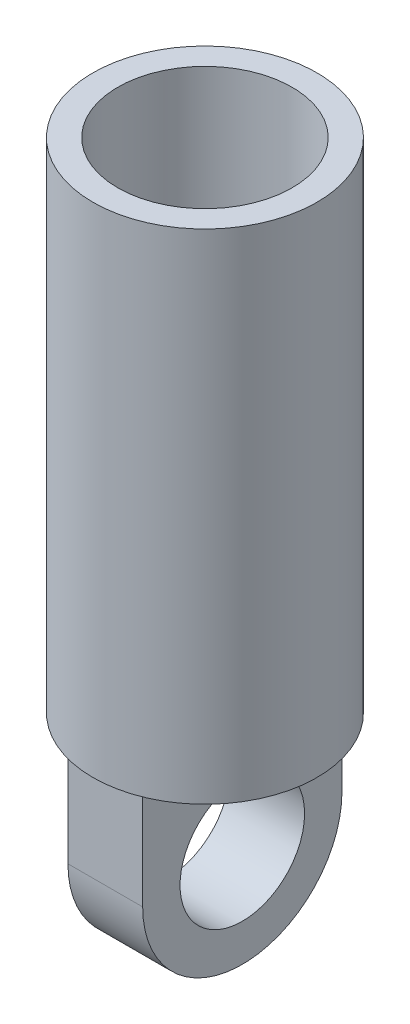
ISO-10303-21;
HEADER;
FILE_DESCRIPTION(('STEP AP214'),'2;1');
FILE_NAME('part.step','',(''),(''),'','','');
FILE_SCHEMA(('AUTOMOTIVE_DESIGN { 1 0 10303 214 1 1 1 1 }'));
ENDSEC;
DATA;
#1=APPLICATION_CONTEXT('core data for automotive mechanical design processes');
#2=APPLICATION_PROTOCOL_DEFINITION('international standard','automotive_design',2000,#1);
#3=PRODUCT_CONTEXT('',#1,'mechanical');
#4=PRODUCT('Part','Part','',(#3));
#5=PRODUCT_RELATED_PRODUCT_CATEGORY('part','',(#4));
#6=PRODUCT_DEFINITION_FORMATION('','',#4);
#7=PRODUCT_DEFINITION_CONTEXT('part definition',#1,'design');
#8=PRODUCT_DEFINITION('design','',#6,#7);
#9=PRODUCT_DEFINITION_SHAPE('','',#8);
#10=(LENGTH_UNIT() NAMED_UNIT(*) SI_UNIT(.MILLI.,.METRE.));
#11=(NAMED_UNIT(*) PLANE_ANGLE_UNIT() SI_UNIT($,.RADIAN.));
#12=(NAMED_UNIT(*) SI_UNIT($,.STERADIAN.) SOLID_ANGLE_UNIT());
#13=UNCERTAINTY_MEASURE_WITH_UNIT(LENGTH_MEASURE(1.E-05),#10,'distance_accuracy_value','');
#14=(GEOMETRIC_REPRESENTATION_CONTEXT(3) GLOBAL_UNCERTAINTY_ASSIGNED_CONTEXT((#13)) GLOBAL_UNIT_ASSIGNED_CONTEXT((#10,
#11,#12)) REPRESENTATION_CONTEXT('',''));
#15=CARTESIAN_POINT('',(0.,0.,0.));
#16=DIRECTION('',(0.,0.,1.));
#17=DIRECTION('',(1.,0.,0.));
#18=AXIS2_PLACEMENT_3D('',#15,#16,#17);
#19=CARTESIAN_POINT('',(37.5,0.,0.));
#20=DIRECTION('',(1.,0.,0.));
#21=DIRECTION('',(0.,0.,-1.));
#22=AXIS2_PLACEMENT_3D('',#19,#20,#21);
#23=PLANE('',#22);
#24=CARTESIAN_POINT('',(37.5,0.,0.));
#25=DIRECTION('',(1.,0.,0.));
#26=DIRECTION('',(0.,0.,-1.));
#27=AXIS2_PLACEMENT_3D('',#24,#25,#26);
#28=CIRCLE('',#27,100.);
#29=CARTESIAN_POINT('',(37.5,0.,100.));
#30=VERTEX_POINT('',#29);
#31=CARTESIAN_POINT('',(37.5,0.,-100.));
#32=VERTEX_POINT('',#31);
#33=EDGE_CURVE('E110',#30,#32,#28,.T.);
#34=ORIENTED_EDGE('',*,*,#33,.T.);
#35=DIRECTION('',(0.,1.,0.));
#36=VECTOR('',#35,1.);
#37=CARTESIAN_POINT('',(37.5,100.,-100.));
#38=LINE('',#37,#36);
#39=CARTESIAN_POINT('',(37.5,100.,-100.));
#40=VERTEX_POINT('',#39);
#41=EDGE_CURVE('E85',#32,#40,#38,.T.);
#42=ORIENTED_EDGE('',*,*,#41,.T.);
#43=DIRECTION('',(0.,0.,1.));
#44=VECTOR('',#43,1.);
#45=CARTESIAN_POINT('',(37.5,100.,100.));
#46=LINE('',#45,#44);
#47=CARTESIAN_POINT('',(37.5,100.,100.));
#48=VERTEX_POINT('',#47);
#49=EDGE_CURVE('E103',#40,#48,#46,.T.);
#50=ORIENTED_EDGE('',*,*,#49,.T.);
#51=DIRECTION('',(0.,-1.,0.));
#52=VECTOR('',#51,1.);
#53=CARTESIAN_POINT('',(37.5,0.,100.));
#54=LINE('',#53,#52);
#55=EDGE_CURVE('E56',#48,#30,#54,.T.);
#56=ORIENTED_EDGE('',*,*,#55,.T.);
#57=EDGE_LOOP('',(#34,#42,#50,#56));
#58=FACE_BOUND('',#57,.T.);
#59=CARTESIAN_POINT('',(37.5,0.,0.));
#60=DIRECTION('',(1.,0.,0.));
#61=DIRECTION('',(0.,0.,-1.));
#62=AXIS2_PLACEMENT_3D('',#59,#60,#61);
#63=CIRCLE('',#62,62.5);
#64=CARTESIAN_POINT('',(37.5,0.,-62.5));
#65=VERTEX_POINT('',#64);
#66=EDGE_CURVE('E113',#65,#65,#63,.T.);
#67=ORIENTED_EDGE('',*,*,#66,.F.);
#68=EDGE_LOOP('',(#67));
#69=FACE_BOUND('',#68,.T.);
#70=ADVANCED_FACE('F39',(#58,#69),#23,.T.);
#71=CARTESIAN_POINT('',(-37.5,0.,0.));
#72=DIRECTION('',(1.,0.,0.));
#73=DIRECTION('',(0.,0.,-1.));
#74=AXIS2_PLACEMENT_3D('',#71,#72,#73);
#75=PLANE('',#74);
#76=CARTESIAN_POINT('',(-37.5,0.,0.));
#77=DIRECTION('',(1.,0.,0.));
#78=DIRECTION('',(0.,0.,-1.));
#79=AXIS2_PLACEMENT_3D('',#76,#77,#78);
#80=CIRCLE('',#79,100.);
#81=CARTESIAN_POINT('',(-37.5,0.,100.));
#82=VERTEX_POINT('',#81);
#83=CARTESIAN_POINT('',(-37.5,0.,-100.));
#84=VERTEX_POINT('',#83);
#85=EDGE_CURVE('E99',#82,#84,#80,.T.);
#86=ORIENTED_EDGE('',*,*,#85,.F.);
#87=DIRECTION('',(0.,-1.,0.));
#88=VECTOR('',#87,1.);
#89=CARTESIAN_POINT('',(-37.5,0.,100.));
#90=LINE('',#89,#88);
#91=CARTESIAN_POINT('',(-37.5,100.,100.));
#92=VERTEX_POINT('',#91);
#93=EDGE_CURVE('E77',#92,#82,#90,.T.);
#94=ORIENTED_EDGE('',*,*,#93,.F.);
#95=DIRECTION('',(0.,0.,1.));
#96=VECTOR('',#95,1.);
#97=CARTESIAN_POINT('',(-37.5,100.,100.));
#98=LINE('',#97,#96);
#99=CARTESIAN_POINT('',(-37.5,100.,-100.));
#100=VERTEX_POINT('',#99);
#101=EDGE_CURVE('E71',#100,#92,#98,.T.);
#102=ORIENTED_EDGE('',*,*,#101,.F.);
#103=DIRECTION('',(0.,1.,0.));
#104=VECTOR('',#103,1.);
#105=CARTESIAN_POINT('',(-37.5,100.,-100.));
#106=LINE('',#105,#104);
#107=EDGE_CURVE('E92',#84,#100,#106,.T.);
#108=ORIENTED_EDGE('',*,*,#107,.F.);
#109=EDGE_LOOP('',(#86,#94,#102,#108));
#110=FACE_BOUND('',#109,.T.);
#111=CARTESIAN_POINT('',(-37.5,0.,0.));
#112=DIRECTION('',(1.,0.,0.));
#113=DIRECTION('',(0.,0.,-1.));
#114=AXIS2_PLACEMENT_3D('',#111,#112,#113);
#115=CIRCLE('',#114,62.5);
#116=CARTESIAN_POINT('',(-37.5,0.,-62.5));
#117=VERTEX_POINT('',#116);
#118=EDGE_CURVE('E118',#117,#117,#115,.T.);
#119=ORIENTED_EDGE('',*,*,#118,.T.);
#120=EDGE_LOOP('',(#119));
#121=FACE_BOUND('',#120,.T.);
#122=ADVANCED_FACE('F90',(#110,#121),#75,.F.);
#123=CARTESIAN_POINT('',(37.5,0.,0.));
#124=DIRECTION('',(-1.,0.,0.));
#125=DIRECTION('',(0.,0.,1.));
#126=AXIS2_PLACEMENT_3D('',#123,#124,#125);
#127=CYLINDRICAL_SURFACE('',#126,100.);
#128=ORIENTED_EDGE('',*,*,#85,.T.);
#129=DIRECTION('',(-1.,0.,0.));
#130=VECTOR('',#129,1.);
#131=CARTESIAN_POINT('',(37.5,0.,-100.));
#132=LINE('',#131,#130);
#133=EDGE_CURVE('E48',#32,#84,#132,.T.);
#134=ORIENTED_EDGE('',*,*,#133,.F.);
#135=ORIENTED_EDGE('',*,*,#33,.F.);
#136=DIRECTION('',(-1.,0.,0.));
#137=VECTOR('',#136,1.);
#138=CARTESIAN_POINT('',(37.5,0.,100.));
#139=LINE('',#138,#137);
#140=EDGE_CURVE('E106',#30,#82,#139,.T.);
#141=ORIENTED_EDGE('',*,*,#140,.T.);
#142=EDGE_LOOP('',(#128,#134,#135,#141));
#143=FACE_BOUND('',#142,.T.);
#144=ADVANCED_FACE('F41',(#143),#127,.T.);
#145=CARTESIAN_POINT('',(37.5,100.,-100.));
#146=DIRECTION('',(0.,0.,1.));
#147=DIRECTION('',(1.,0.,0.));
#148=AXIS2_PLACEMENT_3D('',#145,#146,#147);
#149=PLANE('',#148);
#150=ORIENTED_EDGE('',*,*,#107,.T.);
#151=DIRECTION('',(-1.,0.,0.));
#152=VECTOR('',#151,1.);
#153=CARTESIAN_POINT('',(37.5,100.,-100.));
#154=LINE('',#153,#152);
#155=EDGE_CURVE('E95',#40,#100,#154,.T.);
#156=ORIENTED_EDGE('',*,*,#155,.F.);
#157=ORIENTED_EDGE('',*,*,#41,.F.);
#158=ORIENTED_EDGE('',*,*,#133,.T.);
#159=EDGE_LOOP('',(#150,#156,#157,#158));
#160=FACE_BOUND('',#159,.T.);
#161=ADVANCED_FACE('F94',(#160),#149,.F.);
#162=CARTESIAN_POINT('',(37.5,0.,100.));
#163=DIRECTION('',(0.,0.,-1.));
#164=DIRECTION('',(-1.,0.,0.));
#165=AXIS2_PLACEMENT_3D('',#162,#163,#164);
#166=PLANE('',#165);
#167=ORIENTED_EDGE('',*,*,#93,.T.);
#168=ORIENTED_EDGE('',*,*,#140,.F.);
#169=ORIENTED_EDGE('',*,*,#55,.F.);
#170=DIRECTION('',(-1.,0.,0.));
#171=VECTOR('',#170,1.);
#172=CARTESIAN_POINT('',(37.5,100.,100.));
#173=LINE('',#172,#171);
#174=EDGE_CURVE('E104',#48,#92,#173,.T.);
#175=ORIENTED_EDGE('',*,*,#174,.T.);
#176=EDGE_LOOP('',(#167,#168,#169,#175));
#177=FACE_BOUND('',#176,.T.);
#178=ADVANCED_FACE('F160',(#177),#166,.F.);
#179=CARTESIAN_POINT('',(37.5,0.,0.));
#180=DIRECTION('',(-1.,0.,0.));
#181=DIRECTION('',(0.,0.,1.));
#182=AXIS2_PLACEMENT_3D('',#179,#180,#181);
#183=CYLINDRICAL_SURFACE('',#182,62.5);
#184=ORIENTED_EDGE('',*,*,#66,.T.);
#185=EDGE_LOOP('',(#184));
#186=FACE_BOUND('',#185,.T.);
#187=ORIENTED_EDGE('',*,*,#118,.F.);
#188=EDGE_LOOP('',(#187));
#189=FACE_BOUND('',#188,.T.);
#190=ADVANCED_FACE('F158',(#186,#189),#183,.F.);
#191=CARTESIAN_POINT('',(0.,100.,0.));
#192=DIRECTION('',(0.,1.,0.));
#193=DIRECTION('',(0.,0.,1.));
#194=AXIS2_PLACEMENT_3D('',#191,#192,#193);
#195=PLANE('',#194);
#196=ORIENTED_EDGE('',*,*,#101,.T.);
#197=ORIENTED_EDGE('',*,*,#174,.F.);
#198=ORIENTED_EDGE('',*,*,#49,.F.);
#199=ORIENTED_EDGE('',*,*,#155,.T.);
#200=EDGE_LOOP('',(#196,#197,#198,#199));
#201=FACE_BOUND('',#200,.T.);
#202=CARTESIAN_POINT('',(0.,100.,0.));
#203=DIRECTION('',(0.,1.,0.));
#204=DIRECTION('',(0.,0.,1.));
#205=AXIS2_PLACEMENT_3D('',#202,#203,#204);
#206=CIRCLE('',#205,112.5);
#207=CARTESIAN_POINT('',(0.,100.,112.5));
#208=VERTEX_POINT('',#207);
#209=EDGE_CURVE('E121',#208,#208,#206,.T.);
#210=ORIENTED_EDGE('',*,*,#209,.F.);
#211=EDGE_LOOP('',(#210));
#212=FACE_BOUND('',#211,.T.);
#213=ADVANCED_FACE('F101',(#201,#212),#195,.F.);
#214=CARTESIAN_POINT('',(0.,175.,0.));
#215=DIRECTION('',(0.,-1.,0.));
#216=DIRECTION('',(0.,0.,-1.));
#217=AXIS2_PLACEMENT_3D('',#214,#215,#216);
#218=CYLINDRICAL_SURFACE('',#217,112.5);
#219=ORIENTED_EDGE('',*,*,#209,.T.);
#220=EDGE_LOOP('',(#219));
#221=FACE_BOUND('',#220,.T.);
#222=CARTESIAN_POINT('',(0.,600.,0.));
#223=DIRECTION('',(0.,1.,0.));
#224=DIRECTION('',(0.,0.,1.));
#225=AXIS2_PLACEMENT_3D('',#222,#223,#224);
#226=CIRCLE('',#225,112.5);
#227=CARTESIAN_POINT('',(0.,600.,112.5));
#228=VERTEX_POINT('',#227);
#229=EDGE_CURVE('E126',#228,#228,#226,.T.);
#230=ORIENTED_EDGE('',*,*,#229,.F.);
#231=EDGE_LOOP('',(#230));
#232=FACE_BOUND('',#231,.T.);
#233=ADVANCED_FACE('F137',(#221,#232),#218,.T.);
#234=CARTESIAN_POINT('',(0.,600.,0.));
#235=DIRECTION('',(0.,1.,0.));
#236=DIRECTION('',(0.,0.,1.));
#237=AXIS2_PLACEMENT_3D('',#234,#235,#236);
#238=PLANE('',#237);
#239=ORIENTED_EDGE('',*,*,#229,.T.);
#240=EDGE_LOOP('',(#239));
#241=FACE_BOUND('',#240,.T.);
#242=CARTESIAN_POINT('',(0.,600.,0.));
#243=DIRECTION('',(0.,1.,0.));
#244=DIRECTION('',(0.,0.,1.));
#245=AXIS2_PLACEMENT_3D('',#242,#243,#244);
#246=CIRCLE('',#245,87.5);
#247=CARTESIAN_POINT('',(0.,600.,87.5));
#248=VERTEX_POINT('',#247);
#249=EDGE_CURVE('E129',#248,#248,#246,.T.);
#250=ORIENTED_EDGE('',*,*,#249,.F.);
#251=EDGE_LOOP('',(#250));
#252=FACE_BOUND('',#251,.T.);
#253=ADVANCED_FACE('F135',(#241,#252),#238,.T.);
#254=CARTESIAN_POINT('',(0.,600.,0.));
#255=DIRECTION('',(0.,-1.,0.));
#256=DIRECTION('',(0.,0.,-1.));
#257=AXIS2_PLACEMENT_3D('',#254,#255,#256);
#258=CYLINDRICAL_SURFACE('',#257,87.5);
#259=CARTESIAN_POINT('',(0.,175.,0.));
#260=DIRECTION('',(0.,1.,0.));
#261=DIRECTION('',(0.,0.,1.));
#262=AXIS2_PLACEMENT_3D('',#259,#260,#261);
#263=CIRCLE('',#262,87.5);
#264=CARTESIAN_POINT('',(0.,175.,87.5));
#265=VERTEX_POINT('',#264);
#266=EDGE_CURVE('E11',#265,#265,#263,.F.);
#267=ORIENTED_EDGE('',*,*,#266,.T.);
#268=EDGE_LOOP('',(#267));
#269=FACE_BOUND('',#268,.T.);
#270=ORIENTED_EDGE('',*,*,#249,.T.);
#271=EDGE_LOOP('',(#270));
#272=FACE_BOUND('',#271,.T.);
#273=ADVANCED_FACE('F133',(#269,#272),#258,.F.);
#274=CARTESIAN_POINT('',(0.,175.,0.));
#275=DIRECTION('',(0.,1.,0.));
#276=DIRECTION('',(0.,0.,1.));
#277=AXIS2_PLACEMENT_3D('',#274,#275,#276);
#278=PLANE('',#277);
#279=ORIENTED_EDGE('',*,*,#266,.F.);
#280=EDGE_LOOP('',(#279));
#281=FACE_BOUND('',#280,.T.);
#282=ADVANCED_FACE('F144',(#281),#278,.T.);
#283=CLOSED_SHELL('',(#70,#122,#144,#161,#178,#190,#213,#233,#253,#273,#282));
#284=MANIFOLD_SOLID_BREP('B2',#283);
#285=ADVANCED_BREP_SHAPE_REPRESENTATION('',(#18,#284),#14);
#286=SHAPE_DEFINITION_REPRESENTATION(#9,#285);
ENDSEC;
END-ISO-10303-21;
